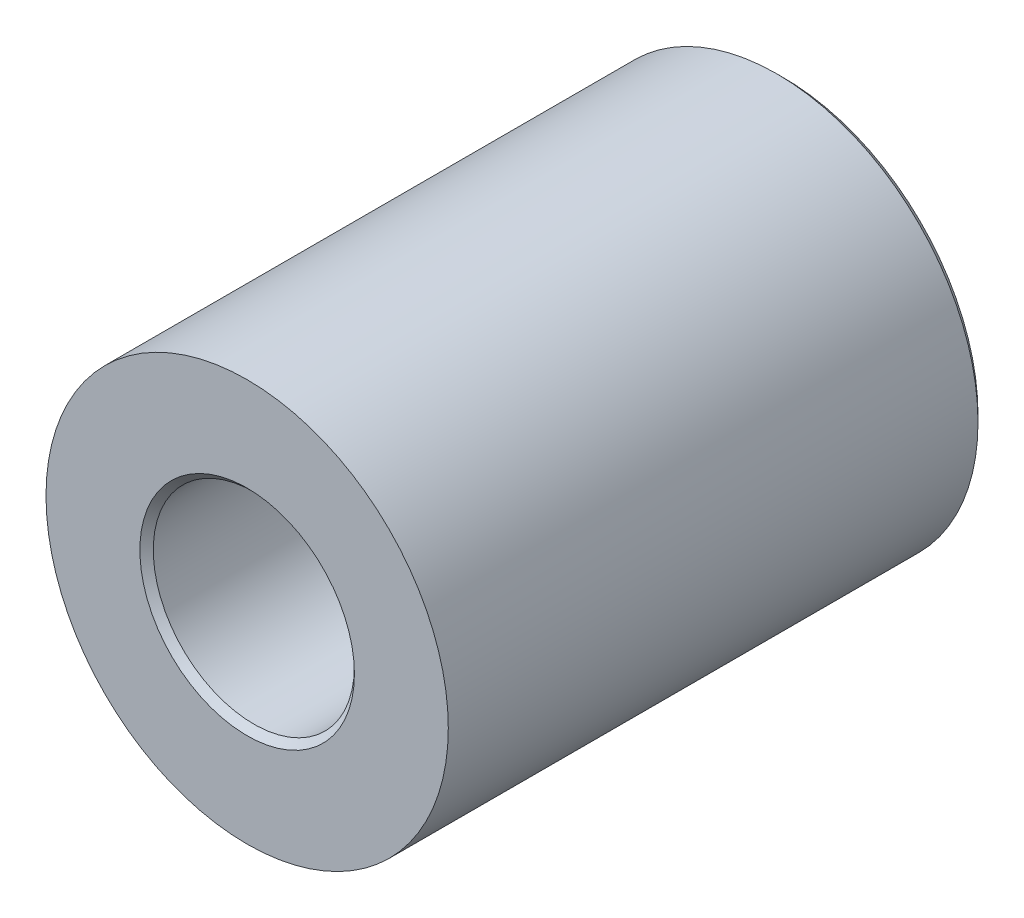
ISO-10303-21;
HEADER;
FILE_DESCRIPTION(('STEP AP214'),'2;1');
FILE_NAME('part.step','',(''),(''),'','','');
FILE_SCHEMA(('AUTOMOTIVE_DESIGN { 1 0 10303 214 1 1 1 1 }'));
ENDSEC;
DATA;
#1=APPLICATION_CONTEXT('core data for automotive mechanical design processes');
#2=APPLICATION_PROTOCOL_DEFINITION('international standard','automotive_design',2000,#1);
#3=PRODUCT_CONTEXT('',#1,'mechanical');
#4=PRODUCT('Part','Part','',(#3));
#5=PRODUCT_RELATED_PRODUCT_CATEGORY('part','',(#4));
#6=PRODUCT_DEFINITION_FORMATION('','',#4);
#7=PRODUCT_DEFINITION_CONTEXT('part definition',#1,'design');
#8=PRODUCT_DEFINITION('design','',#6,#7);
#9=PRODUCT_DEFINITION_SHAPE('','',#8);
#10=(LENGTH_UNIT() NAMED_UNIT(*) SI_UNIT(.MILLI.,.METRE.));
#11=(NAMED_UNIT(*) PLANE_ANGLE_UNIT() SI_UNIT($,.RADIAN.));
#12=(NAMED_UNIT(*) SI_UNIT($,.STERADIAN.) SOLID_ANGLE_UNIT());
#13=UNCERTAINTY_MEASURE_WITH_UNIT(LENGTH_MEASURE(1.E-05),#10,'distance_accuracy_value','');
#14=(GEOMETRIC_REPRESENTATION_CONTEXT(3) GLOBAL_UNCERTAINTY_ASSIGNED_CONTEXT((#13)) GLOBAL_UNIT_ASSIGNED_CONTEXT((#10,
#11,#12)) REPRESENTATION_CONTEXT('',''));
#15=CARTESIAN_POINT('',(0.,0.,0.));
#16=DIRECTION('',(0.,0.,1.));
#17=DIRECTION('',(1.,0.,0.));
#18=AXIS2_PLACEMENT_3D('',#15,#16,#17);
#19=CARTESIAN_POINT('',(0.,0.,8.00000000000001));
#20=DIRECTION('',(0.,0.,-1.));
#21=DIRECTION('',(-1.,0.,0.));
#22=AXIS2_PLACEMENT_3D('',#19,#20,#21);
#23=CYLINDRICAL_SURFACE('',#22,3.);
#24=CARTESIAN_POINT('',(0.,0.,0.100000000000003));
#25=DIRECTION('',(0.,0.,1.));
#26=DIRECTION('',(1.,0.,0.));
#27=AXIS2_PLACEMENT_3D('',#24,#25,#26);
#28=CIRCLE('',#27,3.);
#29=CARTESIAN_POINT('',(3.,0.,0.100000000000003));
#30=VERTEX_POINT('',#29);
#31=EDGE_CURVE('E50',#30,#30,#28,.T.);
#32=ORIENTED_EDGE('',*,*,#31,.T.);
#33=EDGE_LOOP('',(#32));
#34=FACE_BOUND('',#33,.T.);
#35=CARTESIAN_POINT('',(0.,0.,8.00000000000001));
#36=DIRECTION('',(0.,0.,1.));
#37=DIRECTION('',(1.,0.,0.));
#38=AXIS2_PLACEMENT_3D('',#35,#36,#37);
#39=CIRCLE('',#38,3.);
#40=CARTESIAN_POINT('',(3.,0.,8.00000000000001));
#41=VERTEX_POINT('',#40);
#42=EDGE_CURVE('E55',#41,#41,#39,.T.);
#43=ORIENTED_EDGE('',*,*,#42,.F.);
#44=EDGE_LOOP('',(#43));
#45=FACE_BOUND('',#44,.T.);
#46=ADVANCED_FACE('F35',(#34,#45),#23,.T.);
#47=CARTESIAN_POINT('',(0.,0.,8.00000000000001));
#48=DIRECTION('',(0.,0.,1.));
#49=DIRECTION('',(1.,0.,0.));
#50=AXIS2_PLACEMENT_3D('',#47,#48,#49);
#51=PLANE('',#50);
#52=CARTESIAN_POINT('',(0.,0.,8.00000000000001));
#53=DIRECTION('',(0.,0.,1.));
#54=DIRECTION('',(1.,0.,0.));
#55=AXIS2_PLACEMENT_3D('',#52,#53,#54);
#56=CIRCLE('',#55,1.6);
#57=CARTESIAN_POINT('',(1.6,0.,8.00000000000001));
#58=VERTEX_POINT('',#57);
#59=EDGE_CURVE('E10',#58,#58,#56,.F.);
#60=ORIENTED_EDGE('',*,*,#59,.T.);
#61=EDGE_LOOP('',(#60));
#62=FACE_BOUND('',#61,.T.);
#63=ORIENTED_EDGE('',*,*,#42,.T.);
#64=EDGE_LOOP('',(#63));
#65=FACE_BOUND('',#64,.T.);
#66=ADVANCED_FACE('F73',(#62,#65),#51,.T.);
#67=CARTESIAN_POINT('',(0.,0.,0.));
#68=DIRECTION('',(0.,0.,1.));
#69=DIRECTION('',(1.,0.,0.));
#70=AXIS2_PLACEMENT_3D('',#67,#68,#69);
#71=PLANE('',#70);
#72=CARTESIAN_POINT('',(0.,0.,0.));
#73=DIRECTION('',(0.,0.,1.));
#74=DIRECTION('',(1.,0.,0.));
#75=AXIS2_PLACEMENT_3D('',#72,#73,#74);
#76=CIRCLE('',#75,2.9);
#77=CARTESIAN_POINT('',(2.9,0.,0.));
#78=VERTEX_POINT('',#77);
#79=EDGE_CURVE('E46',#78,#78,#76,.F.);
#80=ORIENTED_EDGE('',*,*,#79,.T.);
#81=EDGE_LOOP('',(#80));
#82=FACE_BOUND('',#81,.T.);
#83=CARTESIAN_POINT('',(0.,0.,0.));
#84=DIRECTION('',(0.,0.,1.));
#85=DIRECTION('',(1.,0.,0.));
#86=AXIS2_PLACEMENT_3D('',#83,#84,#85);
#87=CIRCLE('',#86,1.5);
#88=CARTESIAN_POINT('',(1.5,0.,0.));
#89=VERTEX_POINT('',#88);
#90=EDGE_CURVE('E58',#89,#89,#87,.T.);
#91=ORIENTED_EDGE('',*,*,#90,.T.);
#92=EDGE_LOOP('',(#91));
#93=FACE_BOUND('',#92,.T.);
#94=ADVANCED_FACE('F62',(#82,#93),#71,.F.);
#95=CARTESIAN_POINT('',(0.,0.,0.));
#96=DIRECTION('',(0.,0.,1.));
#97=DIRECTION('',(1.,0.,0.));
#98=AXIS2_PLACEMENT_3D('',#95,#96,#97);
#99=CYLINDRICAL_SURFACE('',#98,1.5);
#100=CARTESIAN_POINT('',(0.,0.,7.89999999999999));
#101=DIRECTION('',(0.,0.,1.));
#102=DIRECTION('',(1.,0.,0.));
#103=AXIS2_PLACEMENT_3D('',#100,#101,#102);
#104=CIRCLE('',#103,1.5);
#105=CARTESIAN_POINT('',(1.5,0.,7.89999999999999));
#106=VERTEX_POINT('',#105);
#107=EDGE_CURVE('E42',#106,#106,#104,.T.);
#108=ORIENTED_EDGE('',*,*,#107,.T.);
#109=EDGE_LOOP('',(#108));
#110=FACE_BOUND('',#109,.T.);
#111=ORIENTED_EDGE('',*,*,#90,.F.);
#112=EDGE_LOOP('',(#111));
#113=FACE_BOUND('',#112,.T.);
#114=ADVANCED_FACE('F64',(#110,#113),#99,.F.);
#115=CARTESIAN_POINT('',(0.,0.,0.100000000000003));
#116=DIRECTION('',(0.,0.,1.));
#117=DIRECTION('',(1.,0.,0.));
#118=AXIS2_PLACEMENT_3D('',#115,#116,#117);
#119=CONICAL_SURFACE('',#118,3.,0.785398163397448);
#120=ORIENTED_EDGE('',*,*,#79,.F.);
#121=EDGE_LOOP('',(#120));
#122=FACE_BOUND('',#121,.T.);
#123=ORIENTED_EDGE('',*,*,#31,.F.);
#124=EDGE_LOOP('',(#123));
#125=FACE_BOUND('',#124,.T.);
#126=ADVANCED_FACE('F66',(#122,#125),#119,.T.);
#127=CARTESIAN_POINT('',(0.,0.,7.89999999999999));
#128=DIRECTION('',(0.,0.,1.));
#129=DIRECTION('',(1.,0.,0.));
#130=AXIS2_PLACEMENT_3D('',#127,#128,#129);
#131=CONICAL_SURFACE('',#130,1.5,0.785398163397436);
#132=ORIENTED_EDGE('',*,*,#59,.F.);
#133=EDGE_LOOP('',(#132));
#134=FACE_BOUND('',#133,.T.);
#135=ORIENTED_EDGE('',*,*,#107,.F.);
#136=EDGE_LOOP('',(#135));
#137=FACE_BOUND('',#136,.T.);
#138=ADVANCED_FACE('F37',(#134,#137),#131,.F.);
#139=CLOSED_SHELL('',(#46,#66,#94,#114,#126,#138));
#140=MANIFOLD_SOLID_BREP('B2',#139);
#141=ADVANCED_BREP_SHAPE_REPRESENTATION('',(#18,#140),#14);
#142=SHAPE_DEFINITION_REPRESENTATION(#9,#141);
ENDSEC;
END-ISO-10303-21;
